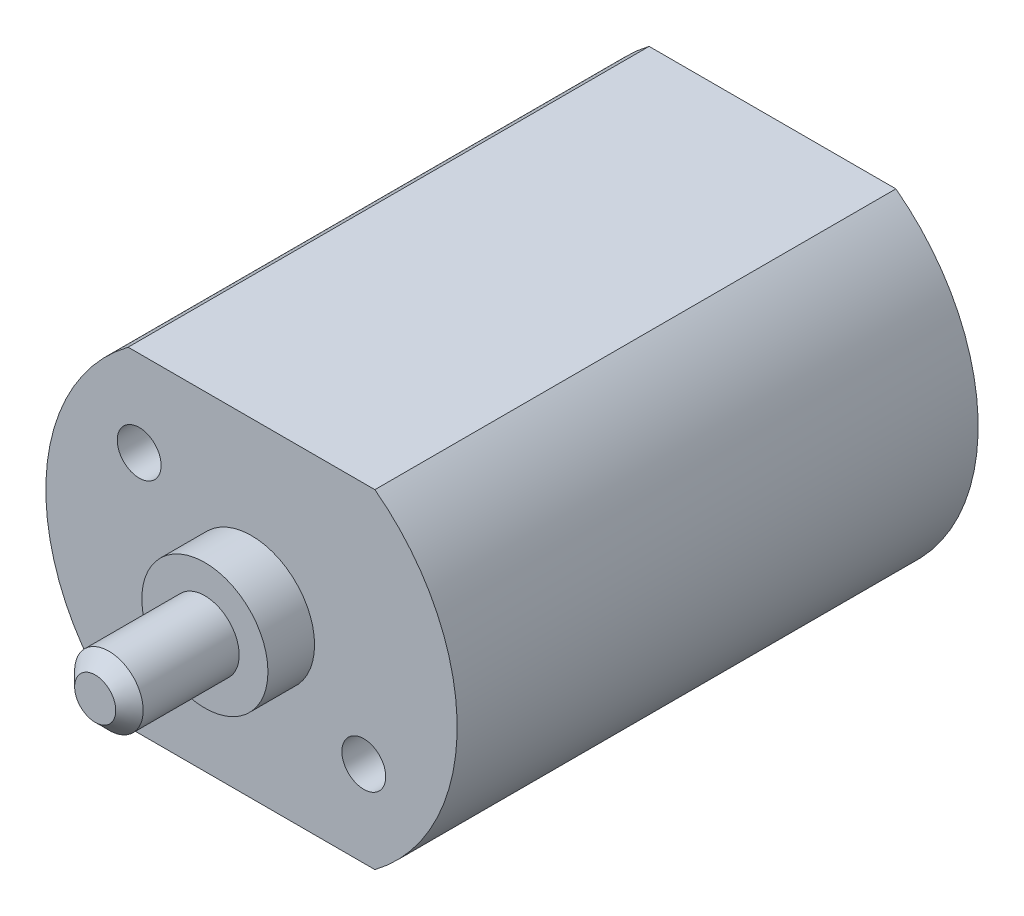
ISO-10303-21;
HEADER;
FILE_DESCRIPTION(('STEP AP214'),'2;1');
FILE_NAME('part.step','',(''),(''),'','','');
FILE_SCHEMA(('AUTOMOTIVE_DESIGN { 1 0 10303 214 1 1 1 1 }'));
ENDSEC;
DATA;
#1=APPLICATION_CONTEXT('core data for automotive mechanical design processes');
#2=APPLICATION_PROTOCOL_DEFINITION('international standard','automotive_design',2000,#1);
#3=PRODUCT_CONTEXT('',#1,'mechanical');
#4=PRODUCT('Part','Part','',(#3));
#5=PRODUCT_RELATED_PRODUCT_CATEGORY('part','',(#4));
#6=PRODUCT_DEFINITION_FORMATION('','',#4);
#7=PRODUCT_DEFINITION_CONTEXT('part definition',#1,'design');
#8=PRODUCT_DEFINITION('design','',#6,#7);
#9=PRODUCT_DEFINITION_SHAPE('','',#8);
#10=(LENGTH_UNIT() NAMED_UNIT(*) SI_UNIT(.MILLI.,.METRE.));
#11=(NAMED_UNIT(*) PLANE_ANGLE_UNIT() SI_UNIT($,.RADIAN.));
#12=(NAMED_UNIT(*) SI_UNIT($,.STERADIAN.) SOLID_ANGLE_UNIT());
#13=UNCERTAINTY_MEASURE_WITH_UNIT(LENGTH_MEASURE(1.E-05),#10,'distance_accuracy_value','');
#14=(GEOMETRIC_REPRESENTATION_CONTEXT(3) GLOBAL_UNCERTAINTY_ASSIGNED_CONTEXT((#13)) GLOBAL_UNIT_ASSIGNED_CONTEXT((#10,
#11,#12)) REPRESENTATION_CONTEXT('',''));
#15=CARTESIAN_POINT('',(0.,0.,0.));
#16=DIRECTION('',(0.,0.,1.));
#17=DIRECTION('',(1.,0.,0.));
#18=AXIS2_PLACEMENT_3D('',#15,#16,#17);
#19=CARTESIAN_POINT('',(0.,0.,19.));
#20=DIRECTION('',(0.,0.,-1.));
#21=DIRECTION('',(-1.,0.,0.));
#22=AXIS2_PLACEMENT_3D('',#19,#20,#21);
#23=CYLINDRICAL_SURFACE('',#22,7.5);
#24=CARTESIAN_POINT('',(0.,0.,0.));
#25=DIRECTION('',(0.,0.,1.));
#26=DIRECTION('',(1.,0.,0.));
#27=AXIS2_PLACEMENT_3D('',#24,#25,#26);
#28=CIRCLE('',#27,7.5);
#29=CARTESIAN_POINT('',(-4.5,6.,0.));
#30=VERTEX_POINT('',#29);
#31=CARTESIAN_POINT('',(-4.5,-6.,0.));
#32=VERTEX_POINT('',#31);
#33=EDGE_CURVE('E102',#30,#32,#28,.T.);
#34=ORIENTED_EDGE('',*,*,#33,.T.);
#35=DIRECTION('',(0.,0.,-1.));
#36=VECTOR('',#35,1.);
#37=CARTESIAN_POINT('',(-4.5,-6.,19.));
#38=LINE('',#37,#36);
#39=CARTESIAN_POINT('',(-4.5,-6.,19.));
#40=VERTEX_POINT('',#39);
#41=EDGE_CURVE('E123',#40,#32,#38,.T.);
#42=ORIENTED_EDGE('',*,*,#41,.F.);
#43=CARTESIAN_POINT('',(0.,0.,19.));
#44=DIRECTION('',(0.,0.,1.));
#45=DIRECTION('',(1.,0.,0.));
#46=AXIS2_PLACEMENT_3D('',#43,#44,#45);
#47=CIRCLE('',#46,7.5);
#48=CARTESIAN_POINT('',(-4.5,6.,19.));
#49=VERTEX_POINT('',#48);
#50=EDGE_CURVE('E105',#49,#40,#47,.T.);
#51=ORIENTED_EDGE('',*,*,#50,.F.);
#52=DIRECTION('',(0.,0.,-1.));
#53=VECTOR('',#52,1.);
#54=CARTESIAN_POINT('',(-4.5,6.,19.));
#55=LINE('',#54,#53);
#56=EDGE_CURVE('E111',#49,#30,#55,.T.);
#57=ORIENTED_EDGE('',*,*,#56,.T.);
#58=EDGE_LOOP('',(#34,#42,#51,#57));
#59=FACE_BOUND('',#58,.T.);
#60=ADVANCED_FACE('F18',(#59),#23,.T.);
#61=CARTESIAN_POINT('',(-4.5,-6.,19.));
#62=DIRECTION('',(0.,1.,0.));
#63=DIRECTION('',(0.,0.,1.));
#64=AXIS2_PLACEMENT_3D('',#61,#62,#63);
#65=PLANE('',#64);
#66=DIRECTION('',(1.,0.,0.));
#67=VECTOR('',#66,1.);
#68=CARTESIAN_POINT('',(-4.5,-6.,0.));
#69=LINE('',#68,#67);
#70=CARTESIAN_POINT('',(4.5,-6.,0.));
#71=VERTEX_POINT('',#70);
#72=EDGE_CURVE('E114',#32,#71,#69,.T.);
#73=ORIENTED_EDGE('',*,*,#72,.T.);
#74=DIRECTION('',(0.,0.,-1.));
#75=VECTOR('',#74,1.);
#76=CARTESIAN_POINT('',(4.5,-6.,19.));
#77=LINE('',#76,#75);
#78=CARTESIAN_POINT('',(4.5,-6.,19.));
#79=VERTEX_POINT('',#78);
#80=EDGE_CURVE('E121',#79,#71,#77,.T.);
#81=ORIENTED_EDGE('',*,*,#80,.F.);
#82=DIRECTION('',(1.,0.,0.));
#83=VECTOR('',#82,1.);
#84=CARTESIAN_POINT('',(-4.5,-6.,19.));
#85=LINE('',#84,#83);
#86=EDGE_CURVE('E67',#40,#79,#85,.T.);
#87=ORIENTED_EDGE('',*,*,#86,.F.);
#88=ORIENTED_EDGE('',*,*,#41,.T.);
#89=EDGE_LOOP('',(#73,#81,#87,#88));
#90=FACE_BOUND('',#89,.T.);
#91=ADVANCED_FACE('F144',(#90),#65,.F.);
#92=CARTESIAN_POINT('',(0.,0.,19.));
#93=DIRECTION('',(0.,0.,-1.));
#94=DIRECTION('',(-1.,0.,0.));
#95=AXIS2_PLACEMENT_3D('',#92,#93,#94);
#96=CYLINDRICAL_SURFACE('',#95,7.5);
#97=CARTESIAN_POINT('',(0.,0.,0.));
#98=DIRECTION('',(0.,0.,1.));
#99=DIRECTION('',(1.,0.,0.));
#100=AXIS2_PLACEMENT_3D('',#97,#98,#99);
#101=CIRCLE('',#100,7.5);
#102=CARTESIAN_POINT('',(4.5,6.,0.));
#103=VERTEX_POINT('',#102);
#104=EDGE_CURVE('E53',#71,#103,#101,.T.);
#105=ORIENTED_EDGE('',*,*,#104,.T.);
#106=DIRECTION('',(0.,0.,-1.));
#107=VECTOR('',#106,1.);
#108=CARTESIAN_POINT('',(4.5,6.,19.));
#109=LINE('',#108,#107);
#110=CARTESIAN_POINT('',(4.5,6.,19.));
#111=VERTEX_POINT('',#110);
#112=EDGE_CURVE('E119',#111,#103,#109,.T.);
#113=ORIENTED_EDGE('',*,*,#112,.F.);
#114=CARTESIAN_POINT('',(0.,0.,19.));
#115=DIRECTION('',(0.,0.,1.));
#116=DIRECTION('',(1.,0.,0.));
#117=AXIS2_PLACEMENT_3D('',#114,#115,#116);
#118=CIRCLE('',#117,7.5);
#119=EDGE_CURVE('E108',#79,#111,#118,.T.);
#120=ORIENTED_EDGE('',*,*,#119,.F.);
#121=ORIENTED_EDGE('',*,*,#80,.T.);
#122=EDGE_LOOP('',(#105,#113,#120,#121));
#123=FACE_BOUND('',#122,.T.);
#124=ADVANCED_FACE('F150',(#123),#96,.T.);
#125=CARTESIAN_POINT('',(-4.5,6.,19.));
#126=DIRECTION('',(0.,-1.,0.));
#127=DIRECTION('',(0.,0.,-1.));
#128=AXIS2_PLACEMENT_3D('',#125,#126,#127);
#129=PLANE('',#128);
#130=DIRECTION('',(-1.,0.,0.));
#131=VECTOR('',#130,1.);
#132=CARTESIAN_POINT('',(-4.5,6.,0.));
#133=LINE('',#132,#131);
#134=EDGE_CURVE('E59',#103,#30,#133,.T.);
#135=ORIENTED_EDGE('',*,*,#134,.T.);
#136=ORIENTED_EDGE('',*,*,#56,.F.);
#137=DIRECTION('',(-1.,0.,0.));
#138=VECTOR('',#137,1.);
#139=CARTESIAN_POINT('',(-4.5,6.,19.));
#140=LINE('',#139,#138);
#141=EDGE_CURVE('E35',#111,#49,#140,.T.);
#142=ORIENTED_EDGE('',*,*,#141,.F.);
#143=ORIENTED_EDGE('',*,*,#112,.T.);
#144=EDGE_LOOP('',(#135,#136,#142,#143));
#145=FACE_BOUND('',#144,.T.);
#146=ADVANCED_FACE('F155',(#145),#129,.F.);
#147=CARTESIAN_POINT('',(0.,0.,19.));
#148=DIRECTION('',(0.,0.,1.));
#149=DIRECTION('',(1.,0.,0.));
#150=AXIS2_PLACEMENT_3D('',#147,#148,#149);
#151=PLANE('',#150);
#152=CARTESIAN_POINT('',(-4.09576022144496,2.86788218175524,19.));
#153=DIRECTION('',(0.,0.,1.));
#154=DIRECTION('',(1.,0.,0.));
#155=AXIS2_PLACEMENT_3D('',#152,#153,#154);
#156=CIRCLE('',#155,0.79999999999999);
#157=CARTESIAN_POINT('',(-3.29576022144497,2.86788218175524,19.));
#158=VERTEX_POINT('',#157);
#159=EDGE_CURVE('E85',#158,#158,#156,.T.);
#160=ORIENTED_EDGE('',*,*,#159,.F.);
#161=EDGE_LOOP('',(#160));
#162=FACE_BOUND('',#161,.T.);
#163=CARTESIAN_POINT('',(4.09576022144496,-2.86788218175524,19.));
#164=DIRECTION('',(0.,0.,1.));
#165=DIRECTION('',(1.,0.,0.));
#166=AXIS2_PLACEMENT_3D('',#163,#164,#165);
#167=CIRCLE('',#166,0.79999999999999);
#168=CARTESIAN_POINT('',(4.89576022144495,-2.86788218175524,19.));
#169=VERTEX_POINT('',#168);
#170=EDGE_CURVE('E84',#169,#169,#167,.T.);
#171=ORIENTED_EDGE('',*,*,#170,.F.);
#172=EDGE_LOOP('',(#171));
#173=FACE_BOUND('',#172,.T.);
#174=CARTESIAN_POINT('',(0.,0.,19.));
#175=DIRECTION('',(0.,0.,1.));
#176=DIRECTION('',(1.,0.,0.));
#177=AXIS2_PLACEMENT_3D('',#174,#175,#176);
#178=CIRCLE('',#177,2.3);
#179=CARTESIAN_POINT('',(2.3,0.,19.));
#180=VERTEX_POINT('',#179);
#181=EDGE_CURVE('E98',#180,#180,#178,.T.);
#182=ORIENTED_EDGE('',*,*,#181,.F.);
#183=EDGE_LOOP('',(#182));
#184=FACE_BOUND('',#183,.T.);
#185=ORIENTED_EDGE('',*,*,#50,.T.);
#186=ORIENTED_EDGE('',*,*,#86,.T.);
#187=ORIENTED_EDGE('',*,*,#119,.T.);
#188=ORIENTED_EDGE('',*,*,#141,.T.);
#189=EDGE_LOOP('',(#185,#186,#187,#188));
#190=FACE_BOUND('',#189,.T.);
#191=ADVANCED_FACE('F158',(#162,#173,#184,#190),#151,.T.);
#192=CARTESIAN_POINT('',(0.,0.,0.));
#193=DIRECTION('',(0.,0.,1.));
#194=DIRECTION('',(1.,0.,0.));
#195=AXIS2_PLACEMENT_3D('',#192,#193,#194);
#196=PLANE('',#195);
#197=ORIENTED_EDGE('',*,*,#33,.F.);
#198=ORIENTED_EDGE('',*,*,#134,.F.);
#199=ORIENTED_EDGE('',*,*,#104,.F.);
#200=ORIENTED_EDGE('',*,*,#72,.F.);
#201=EDGE_LOOP('',(#197,#198,#199,#200));
#202=FACE_BOUND('',#201,.T.);
#203=ADVANCED_FACE('F159',(#202),#196,.F.);
#204=CARTESIAN_POINT('',(0.,0.,20.7));
#205=DIRECTION('',(0.,0.,-1.));
#206=DIRECTION('',(-1.,0.,0.));
#207=AXIS2_PLACEMENT_3D('',#204,#205,#206);
#208=CYLINDRICAL_SURFACE('',#207,2.3);
#209=CARTESIAN_POINT('',(0.,0.,20.7));
#210=DIRECTION('',(0.,0.,1.));
#211=DIRECTION('',(1.,0.,0.));
#212=AXIS2_PLACEMENT_3D('',#209,#210,#211);
#213=CIRCLE('',#212,2.3);
#214=CARTESIAN_POINT('',(2.3,0.,20.7));
#215=VERTEX_POINT('',#214);
#216=EDGE_CURVE('E99',#215,#215,#213,.T.);
#217=ORIENTED_EDGE('',*,*,#216,.F.);
#218=EDGE_LOOP('',(#217));
#219=FACE_BOUND('',#218,.T.);
#220=ORIENTED_EDGE('',*,*,#181,.T.);
#221=EDGE_LOOP('',(#220));
#222=FACE_BOUND('',#221,.T.);
#223=ADVANCED_FACE('F162',(#219,#222),#208,.T.);
#224=CARTESIAN_POINT('',(0.,0.,20.7));
#225=DIRECTION('',(0.,0.,1.));
#226=DIRECTION('',(1.,0.,0.));
#227=AXIS2_PLACEMENT_3D('',#224,#225,#226);
#228=PLANE('',#227);
#229=CARTESIAN_POINT('',(0.,0.,20.7));
#230=DIRECTION('',(0.,0.,1.));
#231=DIRECTION('',(1.,0.,0.));
#232=AXIS2_PLACEMENT_3D('',#229,#230,#231);
#233=CIRCLE('',#232,1.25);
#234=CARTESIAN_POINT('',(1.25,0.,20.7));
#235=VERTEX_POINT('',#234);
#236=EDGE_CURVE('E95',#235,#235,#233,.T.);
#237=ORIENTED_EDGE('',*,*,#236,.F.);
#238=EDGE_LOOP('',(#237));
#239=FACE_BOUND('',#238,.T.);
#240=ORIENTED_EDGE('',*,*,#216,.T.);
#241=EDGE_LOOP('',(#240));
#242=FACE_BOUND('',#241,.T.);
#243=ADVANCED_FACE('F169',(#239,#242),#228,.T.);
#244=CARTESIAN_POINT('',(0.,0.,24.7));
#245=DIRECTION('',(0.,0.,-1.));
#246=DIRECTION('',(-1.,0.,0.));
#247=AXIS2_PLACEMENT_3D('',#244,#245,#246);
#248=CYLINDRICAL_SURFACE('',#247,1.25);
#249=CARTESIAN_POINT('',(0.,0.,24.2));
#250=DIRECTION('',(0.,0.,1.));
#251=DIRECTION('',(1.,0.,0.));
#252=AXIS2_PLACEMENT_3D('',#249,#250,#251);
#253=CIRCLE('',#252,1.25);
#254=CARTESIAN_POINT('',(1.25,0.,24.2));
#255=VERTEX_POINT('',#254);
#256=EDGE_CURVE('E11',#255,#255,#253,.F.);
#257=ORIENTED_EDGE('',*,*,#256,.T.);
#258=EDGE_LOOP('',(#257));
#259=FACE_BOUND('',#258,.T.);
#260=ORIENTED_EDGE('',*,*,#236,.T.);
#261=EDGE_LOOP('',(#260));
#262=FACE_BOUND('',#261,.T.);
#263=ADVANCED_FACE('F140',(#259,#262),#248,.T.);
#264=CARTESIAN_POINT('',(0.,0.,24.7));
#265=DIRECTION('',(0.,0.,1.));
#266=DIRECTION('',(1.,0.,0.));
#267=AXIS2_PLACEMENT_3D('',#264,#265,#266);
#268=PLANE('',#267);
#269=CARTESIAN_POINT('',(0.,0.,24.7));
#270=DIRECTION('',(0.,0.,1.));
#271=DIRECTION('',(1.,0.,0.));
#272=AXIS2_PLACEMENT_3D('',#269,#270,#271);
#273=CIRCLE('',#272,0.75);
#274=CARTESIAN_POINT('',(0.75,0.,24.7));
#275=VERTEX_POINT('',#274);
#276=EDGE_CURVE('E27',#275,#275,#273,.T.);
#277=ORIENTED_EDGE('',*,*,#276,.T.);
#278=EDGE_LOOP('',(#277));
#279=FACE_BOUND('',#278,.T.);
#280=ADVANCED_FACE('F127',(#279),#268,.T.);
#281=CARTESIAN_POINT('',(0.,0.,24.7));
#282=DIRECTION('',(0.,0.,-1.));
#283=DIRECTION('',(-1.,0.,0.));
#284=AXIS2_PLACEMENT_3D('',#281,#282,#283);
#285=CONICAL_SURFACE('',#284,0.75,0.785398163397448);
#286=ORIENTED_EDGE('',*,*,#256,.F.);
#287=EDGE_LOOP('',(#286));
#288=FACE_BOUND('',#287,.T.);
#289=ORIENTED_EDGE('',*,*,#276,.F.);
#290=EDGE_LOOP('',(#289));
#291=FACE_BOUND('',#290,.T.);
#292=ADVANCED_FACE('F20',(#288,#291),#285,.T.);
#293=CARTESIAN_POINT('',(4.09576022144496,-2.86788218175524,13.));
#294=DIRECTION('',(0.,0.,1.));
#295=DIRECTION('',(1.,0.,0.));
#296=AXIS2_PLACEMENT_3D('',#293,#294,#295);
#297=CONICAL_SURFACE('',#296,0.799999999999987,1.02974425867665);
#298=CARTESIAN_POINT('',(4.09576022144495,-2.86788218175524,12.5193115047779));
#299=VERTEX_POINT('',#298);
#300=VERTEX_LOOP('',#299);
#301=FACE_BOUND('',#300,.T.);
#302=CARTESIAN_POINT('',(4.09576022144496,-2.86788218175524,13.));
#303=DIRECTION('',(0.,0.,1.));
#304=DIRECTION('',(1.,0.,0.));
#305=AXIS2_PLACEMENT_3D('',#302,#303,#304);
#306=CIRCLE('',#305,0.799999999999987);
#307=CARTESIAN_POINT('',(4.89576022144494,-2.86788218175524,13.));
#308=VERTEX_POINT('',#307);
#309=EDGE_CURVE('E88',#308,#308,#306,.T.);
#310=ORIENTED_EDGE('',*,*,#309,.T.);
#311=EDGE_LOOP('',(#310));
#312=FACE_BOUND('',#311,.T.);
#313=ADVANCED_FACE('F130',(#301,#312),#297,.F.);
#314=CARTESIAN_POINT('',(4.09576022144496,-2.86788218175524,19.));
#315=DIRECTION('',(0.,0.,1.));
#316=DIRECTION('',(1.,0.,0.));
#317=AXIS2_PLACEMENT_3D('',#314,#315,#316);
#318=CYLINDRICAL_SURFACE('',#317,0.799999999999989);
#319=ORIENTED_EDGE('',*,*,#309,.F.);
#320=EDGE_LOOP('',(#319));
#321=FACE_BOUND('',#320,.T.);
#322=ORIENTED_EDGE('',*,*,#170,.T.);
#323=EDGE_LOOP('',(#322));
#324=FACE_BOUND('',#323,.T.);
#325=ADVANCED_FACE('F78',(#321,#324),#318,.F.);
#326=CARTESIAN_POINT('',(-4.09576022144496,2.86788218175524,13.));
#327=DIRECTION('',(0.,0.,1.));
#328=DIRECTION('',(1.,0.,0.));
#329=AXIS2_PLACEMENT_3D('',#326,#327,#328);
#330=CONICAL_SURFACE('',#329,0.799999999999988,1.02974425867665);
#331=CARTESIAN_POINT('',(-4.09576022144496,2.86788218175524,12.5193115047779));
#332=VERTEX_POINT('',#331);
#333=VERTEX_LOOP('',#332);
#334=FACE_BOUND('',#333,.T.);
#335=CARTESIAN_POINT('',(-4.09576022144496,2.86788218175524,13.));
#336=DIRECTION('',(0.,0.,1.));
#337=DIRECTION('',(1.,0.,0.));
#338=AXIS2_PLACEMENT_3D('',#335,#336,#337);
#339=CIRCLE('',#338,0.799999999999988);
#340=CARTESIAN_POINT('',(-3.29576022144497,2.86788218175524,13.));
#341=VERTEX_POINT('',#340);
#342=EDGE_CURVE('E82',#341,#341,#339,.T.);
#343=ORIENTED_EDGE('',*,*,#342,.T.);
#344=EDGE_LOOP('',(#343));
#345=FACE_BOUND('',#344,.T.);
#346=ADVANCED_FACE('F74',(#334,#345),#330,.F.);
#347=CARTESIAN_POINT('',(-4.09576022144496,2.86788218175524,19.));
#348=DIRECTION('',(0.,0.,1.));
#349=DIRECTION('',(1.,0.,0.));
#350=AXIS2_PLACEMENT_3D('',#347,#348,#349);
#351=CYLINDRICAL_SURFACE('',#350,0.799999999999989);
#352=ORIENTED_EDGE('',*,*,#342,.F.);
#353=EDGE_LOOP('',(#352));
#354=FACE_BOUND('',#353,.T.);
#355=ORIENTED_EDGE('',*,*,#159,.T.);
#356=EDGE_LOOP('',(#355));
#357=FACE_BOUND('',#356,.T.);
#358=ADVANCED_FACE('F77',(#354,#357),#351,.F.);
#359=CLOSED_SHELL('',(#60,#91,#124,#146,#191,#203,#223,#243,#263,#280,#292,#313,#325,#346,#358));
#360=MANIFOLD_SOLID_BREP('B1',#359);
#361=ADVANCED_BREP_SHAPE_REPRESENTATION('',(#18,#360),#14);
#362=SHAPE_DEFINITION_REPRESENTATION(#9,#361);
ENDSEC;
END-ISO-10303-21;
